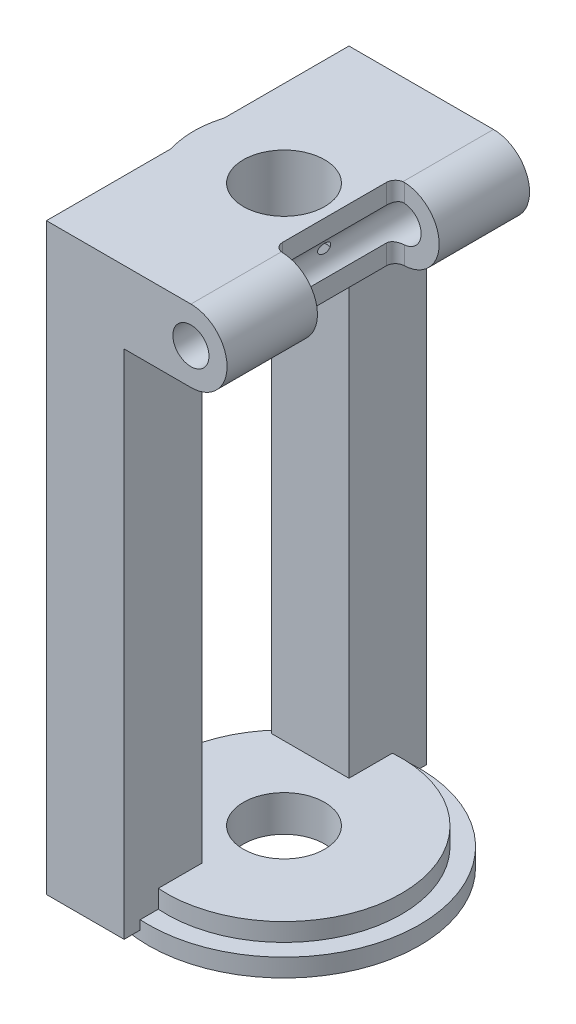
from build123d import *

# Parameters (mm, degrees)
SKETCH1_R           = 2
BASE_EXTRUDE_DEPTH  = 16.75
BOSS_EXTRUDE1_DEPTH = 8
SKETCH3_W           = 8.6
SKETCH3_H           = 8.6
BOSS_EXTRUDE2_DEPTH = 56.629063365
SKETCH4_R           = 4.5
CUT_EXTRUDE1_DEPTH  = 73.915954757
SKETCH6_W           = 4.847074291
SKETCH6_H           = 13.486918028
CUT_EXTRUDE2_DEPTH  = 8
FILLET1_R           = 1


with BuildPart() as part:
    # Sketch1 → Base-Extrude (new, symmetric)
    with BuildSketch(Plane.XY):
        with BuildLine():
            Line((18.440489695, 110.629063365), (2.440489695, 110.629063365))
            Line((2.440489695, 110.629063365), (2.440489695, 118.629063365))
            Line((2.440489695, 118.629063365), (18.440489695, 118.629063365))
            ThreePointArc((18.440489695, 118.629063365), (22.440489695, 114.629063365), (18.440489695, 110.629063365))
        make_face()
        with Locations((18.440489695, 114.629063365)):
            Circle(SKETCH1_R, mode=Mode.SUBTRACT)
    extrude(amount=BASE_EXTRUDE_DEPTH, both=True)

    # Sketch2 → Boss-Extrude1 (add)
    with BuildSketch(Plane(origin=(0, 118.629063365, 0), x_dir=(-1, 0, 0), z_dir=(0, 1, 0))):
        with BuildLine():
            Line((-2.440489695, 2.935261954), (-2.440489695, -2.935261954))
            ThreePointArc((-2.440489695, -2.935261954), (-2, 0), (-2.440489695, 2.935261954))
        make_face()
    extrude(amount=-BOSS_EXTRUDE1_DEPTH)

    # Sketch3 → Boss-Extrude2 (add)
    with BuildSketch(Plane.XZ.offset(-110.629063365)):
        with Locations((6.740489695, -12.45)):
            Rectangle(SKETCH3_W, SKETCH3_H)
        with Locations((6.740489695, 12.45)):
            Rectangle(SKETCH3_W, SKETCH3_H)
    extrude(amount=BOSS_EXTRUDE2_DEPTH)

    # Sketch5 → Boss-Revolve1 (revolve)
    with BuildSketch(Plane.XY, mode=Mode.PRIVATE) as boss_revolve1_sk:
        Polygon((12, 57), (-1, 57), (-1, 55), (-3, 55), (-3, 53), (12, 53), align=None)
    revolve(boss_revolve1_sk.sketch.rotate(Axis((12, 112.476642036, 0), (0, -1, 0)), 270), axis=Axis((12, 112.476642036, 0), (0, -1, 0)))

    # Sketch4 → Cut-Extrude1 (cut, through all)
    with BuildSketch(Plane(origin=(0, 118.629063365, 0), x_dir=(-1, 0, 0), z_dir=(0, 1, 0))):
        with Locations(Location((-12, 0, 0), (0, 0, 90))):
            Circle(SKETCH4_R)
    extrude(amount=-CUT_EXTRUDE1_DEPTH, mode=Mode.SUBTRACT)

    # Sketch6 → Cut-Extrude2 (cut)
    with BuildSketch(Plane(origin=(0, 118.629063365, 0), x_dir=(-1, 0, 0), z_dir=(0, 1, 0))):
        with Locations((-20.01695255, 0)):
            Rectangle(SKETCH6_W, SKETCH6_H)
    extrude(amount=-CUT_EXTRUDE2_DEPTH, mode=Mode.SUBTRACT)

    # Fillet1
    fillet1_edges = [part.edges().sort_by_distance(p)[0] for p in [
        (17.593415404, 117.534942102, 6.743459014),
        (17.593415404, 117.534942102, -6.743459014),
        (17.593415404, 111.723184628, 6.743459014),
        (17.593415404, 111.723184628, -6.743459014),
    ]]
    fillet(fillet1_edges, radius=FILLET1_R)


solid = part.part
